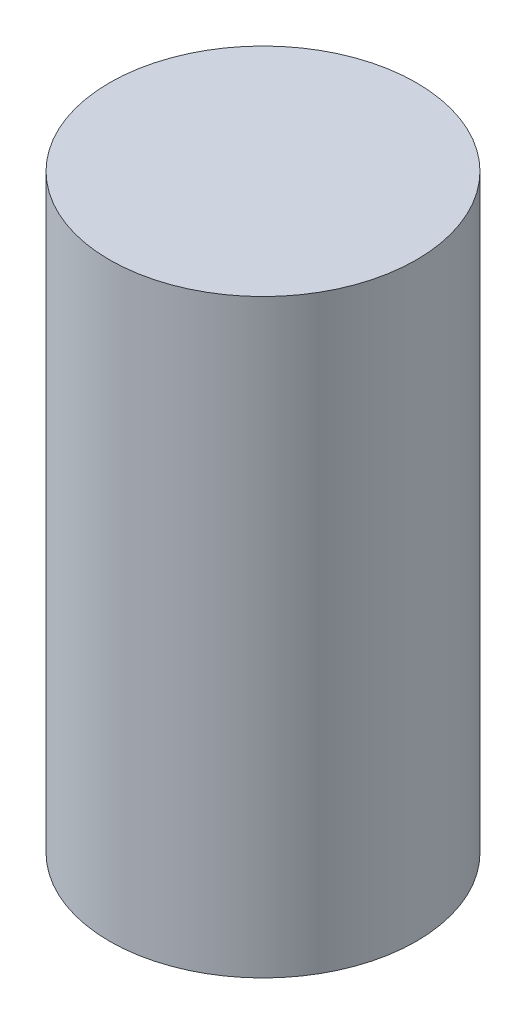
from build123d import *

# Parameters (mm, degrees)
SKETCH1_R           = 41.275
BOSS_EXTRUDE1_DEPTH = 158.75


with BuildPart() as part:
    # Sketch1 → Boss-Extrude1 (new body)
    with BuildSketch(Plane(origin=(0, 0, 0), x_dir=(1, 0, 0), z_dir=(0, 1, 0))):
        with Locations(Location((0, 0, 0), (0, 0, 270))):
            Circle(SKETCH1_R)
    extrude(amount=-BOSS_EXTRUDE1_DEPTH)


solid = part.part
